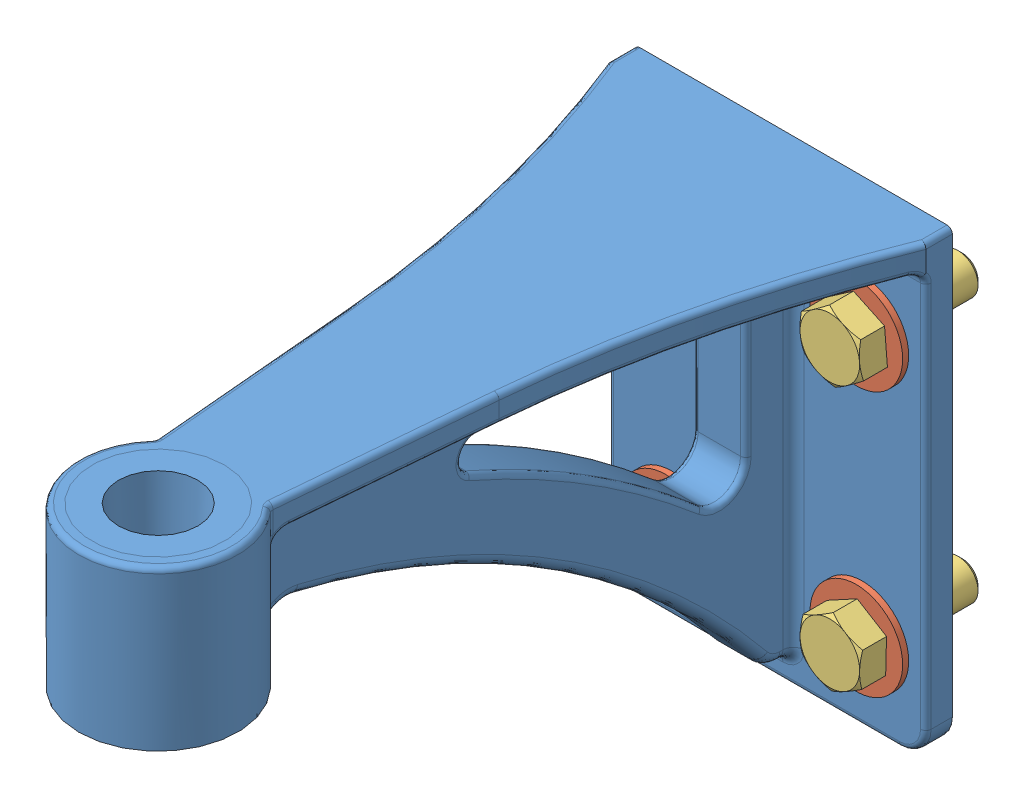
SolidWorks assembly 3.3.SLDASM, configuration Default (file format 10000). Lengths in mm.
Overall size (76.62 107.95 189.05).
9 component instances, 3 part files, 16 mates.
Components (placement in the parent):
- 3.3-1-1: 3.3-1.SLDPRT [Default] at (14.8336 57.8446 85.725) size (76.62 107.95 171.45)
- 3.3-2-1: 3.3-2.SLDPRT [92141A031] at (-8.0264 32.4446 92.075) x (0.976912 0.213644 0) z (0.213644 -0.976912 0) size (22.23 1.45 22.23)
- 3.3-2-2: 3.3-2.SLDPRT [92141A031] at (37.6936 32.4446 92.075) x (0.241843 -0.970315 0) z (-0.970315 -0.241843 0) size (22.23 1.45 22.23)
- 3.3-3-2: 3.3-3.SLDPRT [92865A624] at (-8.0264 32.4446 83.9978) x (0 0 -1) z (0.659268 -0.751908 0) size (31.75 16.5 14.29)
- 3.3-3-3: 3.3-3.SLDPRT [92865A624] at (-8.0264 -31.0554 83.9978) x (0 0 -1) z (0.350224 -0.936666 0) size (31.75 16.5 14.29)
- 3.3-3-4: 3.3-3.SLDPRT [92865A624] at (37.6936 -31.0554 83.9978) x (0 0 -1) z (0.999686 -0.02505 0) size (31.75 16.5 14.29)
- 3.3-3-5: 3.3-3.SLDPRT [92865A624] at (37.6936 32.4446 83.9978) x (0 0 -1) z (0.570876 -0.821036 0) size (31.75 16.5 14.29)
- 3.3-2-3: 3.3-2.SLDPRT [92141A031] at (-8.0264 -31.0554 92.075) x (0.969782 -0.243975 0) z (-0.243975 -0.969782 0) size (22.23 1.45 22.23)
- 3.3-2-4: 3.3-2.SLDPRT [92141A031] at (37.6936 -31.0554 92.075) x (0.023943 -0.999713 0) z (-0.999713 -0.023943 0) size (22.23 1.45 22.23)
Mates (geometry in assembly coordinates):
- Concentric2: concentric aligned: cylinder of 3.3-1-1 through (-8.0264 32.4446 85.724) axis (0 0 1) radius 5.08; cylinder of 3.3-2-1 through (-8.0264 32.4446 168.6337) axis (0 0 1) radius 5.1562
- Concentric3: concentric aligned: cylinder of 3.3-1-1 through (-8.0264 -31.0554 85.724) axis (0 0 1) radius 5.08; cylinder of 3.3-2-3 through (-8.0264 -31.0554 140.8565) axis (0 0 1) radius 5.1562
- Concentric4: concentric aligned: cylinder of 3.3-1-1 through (37.6936 -31.0554 85.724) axis (0 0 1) radius 5.08; cylinder of 3.3-2-4 through (37.6936 -31.0554 165.2819) axis (0 0 1) radius 5.1562
- Concentric5: concentric aligned: cylinder of 3.3-1-1 through (37.6936 32.4446 85.724) axis (0 0 1) radius 5.08; cylinder of 3.3-2-2 through (37.6936 32.4446 148.0034) axis (0 0 1) radius 5.1562
- Concentric6: concentric anti-aligned: cylinder of 3.3-1-1 through (37.6936 -31.0554 85.724) axis (0 0 1) radius 5.08; cylinder of 3.3-3-4 through (37.6936 -31.0554 166.7297) axis (0 0 -1) radius 4.7625
- Coincident5: coincident anti-aligned: plane of 3.3-3-4 through (44.9384 -27.1112 166.7297) normal (0 0 -1); plane of 3.3-2-4 through (37.6936 -31.0554 166.7297) normal (0 0 1)
- Coincident6: coincident anti-aligned: plane of 3.3-2-2 through (37.6936 32.4446 149.4512) normal (0 0 1); plane of 3.3-3-5 through (45.1581 28.9339 149.4512) normal (0 0 -1)
- Concentric7: concentric anti-aligned: cylinder of 3.3-2-2 through (37.6936 32.4446 148.0034) axis (0 0 1) radius 5.1562; cylinder of 3.3-3-5 through (37.6936 32.4446 149.4512) axis (0 0 -1) radius 4.7625
- Concentric8: concentric anti-aligned: cylinder of 3.3-2-1 through (-8.0264 32.4446 168.6337) axis (0 0 1) radius 5.1562; cylinder of 3.3-3-2 through (-8.0264 32.4446 170.0815) axis (0 0 -1) radius 4.7625
- Coincident7: coincident anti-aligned: plane of 3.3-2-1 through (-8.0264 32.4446 170.0815) normal (0 0 1); plane of 3.3-3-2 through (-0.2156 29.7923 170.0815) normal (0 0 -1)
- Concentric9: concentric anti-aligned: cylinder of 3.3-3-3 through (-8.0264 -31.0554 142.3043) axis (0 0 -1) radius 4.7625; cylinder of 3.3-2-3 through (-8.0264 -31.0554 140.8565) axis (0 0 1) radius 5.1562
- Coincident8: coincident anti-aligned: plane of 3.3-3-3 through (-1.6613 -36.3022 142.3043) normal (0 0 -1); plane of 3.3-2-3 through (-8.0264 -31.0554 142.3043) normal (0 0 1)
- Coincident9: coincident anti-aligned: plane of 3.3-1-1 through (14.8336 57.8446 92.075) normal (0 0 1); plane of 3.3-2-2 through (37.6936 32.4446 92.075) normal (0 0 -1)
- Coincident10: coincident anti-aligned: plane of 3.3-1-1 through (14.8336 57.8446 92.075) normal (0 0 1); plane of 3.3-2-4 through (37.6936 -31.0554 92.075) normal (0 0 -1)
- Coincident11: coincident anti-aligned: plane of 3.3-1-1 through (14.8336 57.8446 92.075) normal (0 0 1); plane of 3.3-2-3 through (-8.0264 -31.0554 92.075) normal (0 0 -1)
- Coincident12: coincident anti-aligned: plane of 3.3-1-1 through (14.8336 57.8446 92.075) normal (0 0 1); plane of 3.3-2-1 through (-8.0264 32.4446 92.075) normal (0 0 -1)
